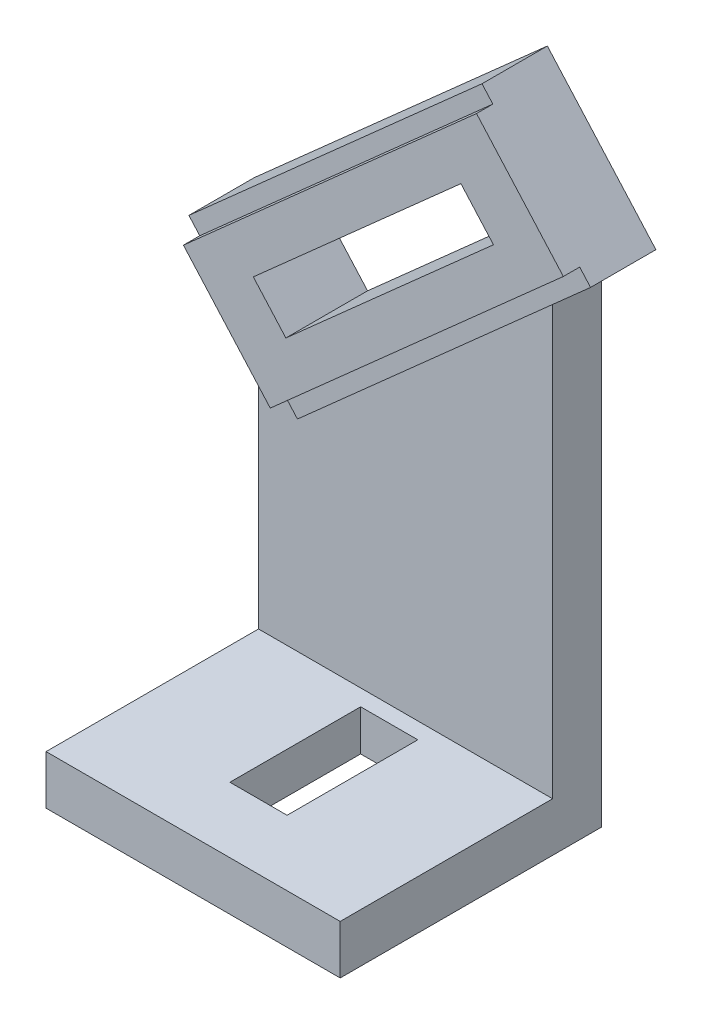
from build123d import *

# Parameters (mm, degrees)
SKETCH_2_W          = 36
SKETCH_2_H          = 32
SKETCH_2_W_2        = 7
SKETCH_2_H_2        = 16
EXTRUDE_1_DEPTH     = 6
SKETCH_3_W          = 20
SKETCH_3_H          = 24
CUT_EXTRUDE_1_DEPTH = 1
FILLET_1_R          = 0.5
EXTRUDE_2_DEPTH     = 6
EXTRUDE_3_DEPTH     = 10
CUT_EXTRUDE_2_DEPTH = 2
CUT_EXTRUDE_3_DEPTH = 87.066488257


with BuildPart() as part:
    # Sketch 2 → Extrude 1 (new body)
    with BuildSketch(Plane(origin=(0, 0, 0), x_dir=(1, 0, 0), z_dir=(0, 1, 0))):
        Rectangle(SKETCH_2_W, SKETCH_2_H)
        Rectangle(SKETCH_2_W_2, SKETCH_2_H_2, mode=Mode.SUBTRACT)
    extrude(amount=EXTRUDE_1_DEPTH)

    # Sketch 3 → Cut-Extrude 1 (cut)
    with BuildSketch(Plane.XZ):
        Rectangle(SKETCH_3_W, SKETCH_3_H)
    extrude(amount=-CUT_EXTRUDE_1_DEPTH, mode=Mode.SUBTRACT)

    # Fillet 1
    fillet_1_edges = [part.edges().sort_by_distance(p)[0] for p in [
        (-10, 1, 0),
        (0, 1, 12),
        (10, 1, 0),
        (0, 1, -12),
    ]]
    fillet(fillet_1_edges, radius=FILLET_1_R)

    # Sketch 4 → Extrude 2 (add)
    with BuildSketch(Plane(origin=(0, 0, -16), x_dir=(-1, 0, 0), z_dir=(0, 0, -1))):
        Polygon((18, 0), (-18, 0), (-18, 72), (18, 40), align=None)
    extrude(amount=-EXTRUDE_2_DEPTH)

    # Sketch 5 → Extrude 3 (add)
    with BuildSketch(Plane(origin=(0, 0, -16), x_dir=(-1, 0, 0), z_dir=(0, 0, -1))):
        Polygon((-24.643638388, 64.525906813), (11.232008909, 32.636442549), (24.519285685, 47.584628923), (-11.356361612, 79.474093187), align=None)
    extrude(amount=-EXTRUDE_3_DEPTH)

    # Sketch 6 → Cut-Extrude 2 (cut)
    with BuildSketch(Plane.XY.offset(-6)):
        Polygon((-12.560736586, 34.131261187), (23.314910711, 66.020725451), (24.643638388, 64.525906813), (-11.232008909, 32.636442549), align=None)
        Polygon((12.685089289, 77.979274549), (11.356361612, 79.474093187), (-24.519285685, 47.584628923), (-23.190558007, 46.089810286), align=None)
    extrude(amount=-CUT_EXTRUDE_2_DEPTH, mode=Mode.SUBTRACT)

    # Sketch 7 → Cut-Extrude 3 (cut, through all)
    with BuildSketch(Plane.XY.offset(-6)):
        Polygon((-14.636873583, 47.003310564), (10.775043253, 69.591681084), (14.761226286, 65.107225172), (-10.65069055, 42.518854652), align=None)
    extrude(amount=-CUT_EXTRUDE_3_DEPTH, mode=Mode.SUBTRACT)


solid = part.part
